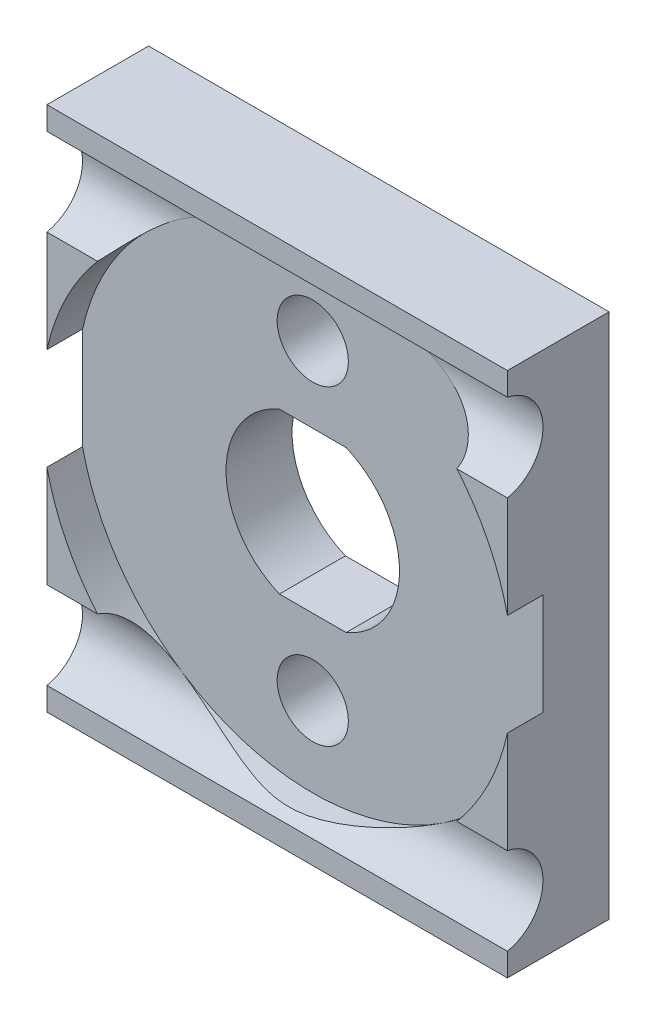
from build123d import *

# Parameters (mm, degrees)
ESQUISSE1_W             = 20.7
ESQUISSE1_H             = 23.65
EXTRUSION1_DEPTH        = 4.57
ENL_V_MAT_EXTRU_1_DEPTH = 32.759996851
ESQUISSE3_R             = 1.6
ENL_V_MAT_EXTRU_2_DEPTH = 32.759996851
ESQUISSE4_R             = 10.6
ENL_V_MAT_EXTRU_3_DEPTH = 1.6
ESQUISSE7_R             = 2
ENL_V_MAT_EXTRU_6_DEPTH = 32.759996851


with BuildPart() as part:
    # Esquisse1 → Extrusion1 (new body)
    with BuildSketch(Plane.XY):
        with Locations((-10.35, 11.825)):
            Rectangle(ESQUISSE1_W, ESQUISSE1_H)
    extrude(amount=EXTRUSION1_DEPTH)

    # Esquisse2 → Enl_v. mat.-Extru.1 (cut, through all)
    with BuildSketch(Plane.XY.offset(4.57)):
        with BuildLine():
            Line((-11.85, 8.225), (-8.85, 8.225))
            ThreePointArc((-8.85, 8.225), (-6.45, 11.825), (-8.85, 15.425))
            Line((-8.85, 15.425), (-11.85, 15.425))
            ThreePointArc((-11.85, 15.425), (-14.25, 11.825), (-11.85, 8.225))
        make_face()
    extrude(amount=-ENL_V_MAT_EXTRU_1_DEPTH, mode=Mode.SUBTRACT)

    # Esquisse3 → Enl_v. mat.-Extru.2 (cut, through all)
    with BuildSketch(Plane.XY.offset(4.57)):
        with Locations((-10.35, 18.825)):
            Circle(ESQUISSE3_R)
        with Locations(Location((-10.35, 4.825, 0), (0, 0, 180))):
            Circle(ESQUISSE3_R)
    extrude(amount=-ENL_V_MAT_EXTRU_2_DEPTH, mode=Mode.SUBTRACT)

    # Esquisse4 → Enl_v. mat.-Extru.3 (cut)
    with BuildSketch(Plane.XY.offset(4.57)):
        with Locations((-10.35, 11.825)):
            Circle(ESQUISSE4_R)
    extrude(amount=-ENL_V_MAT_EXTRU_3_DEPTH, mode=Mode.SUBTRACT)

    # Esquisse7 → Enl_v. mat.-Extru.6 (cut, through all)
    with BuildSketch(Plane(origin=(0, 0, 0), x_dir=(0, 0, -1), z_dir=(1, 0, 0))):
        with Locations((-4.97, 20.65)):
            Circle(ESQUISSE7_R)
        with Locations((-4.97, 3)):
            Circle(ESQUISSE7_R)
    extrude(amount=-ENL_V_MAT_EXTRU_6_DEPTH, mode=Mode.SUBTRACT)


solid = part.part
